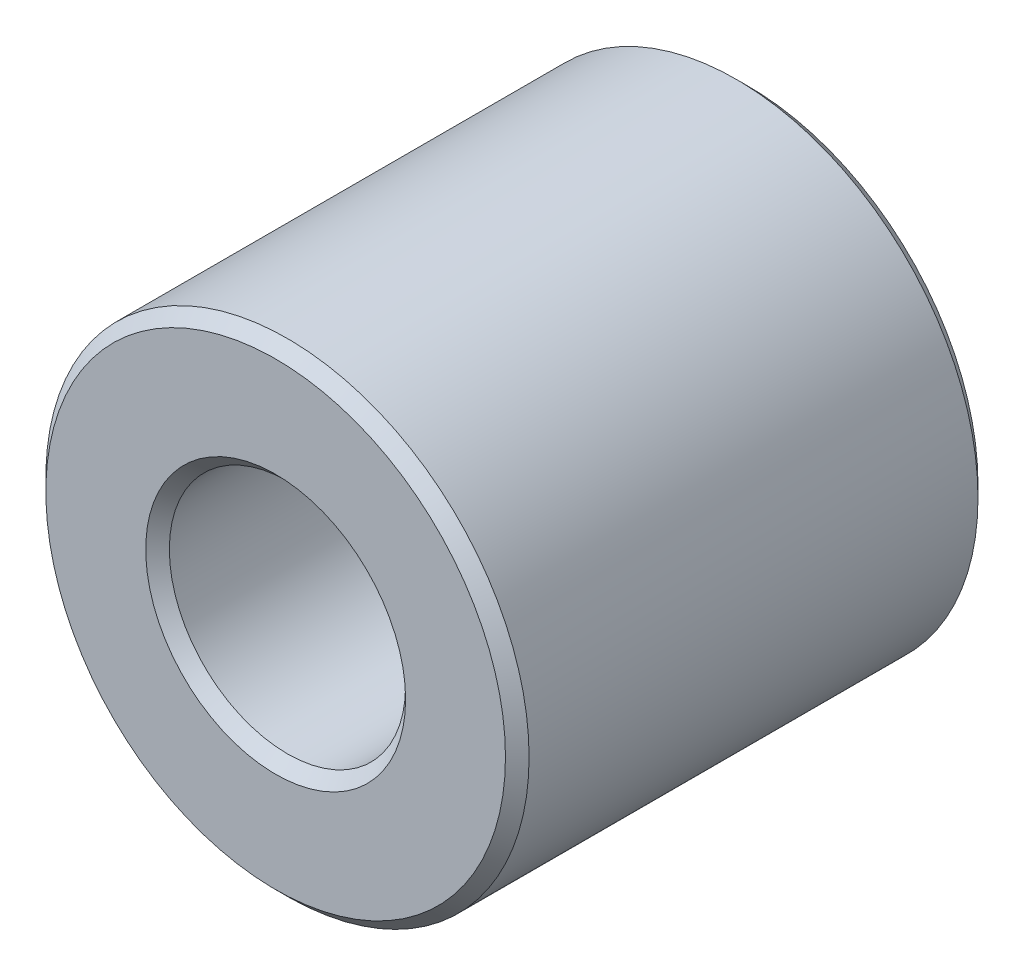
ISO-10303-21;
HEADER;
FILE_DESCRIPTION(('STEP AP214'),'2;1');
FILE_NAME('part.step','',(''),(''),'','','');
FILE_SCHEMA(('AUTOMOTIVE_DESIGN { 1 0 10303 214 1 1 1 1 }'));
ENDSEC;
DATA;
#1=APPLICATION_CONTEXT('core data for automotive mechanical design processes');
#2=APPLICATION_PROTOCOL_DEFINITION('international standard','automotive_design',2000,#1);
#3=PRODUCT_CONTEXT('',#1,'mechanical');
#4=PRODUCT('Part','Part','',(#3));
#5=PRODUCT_RELATED_PRODUCT_CATEGORY('part','',(#4));
#6=PRODUCT_DEFINITION_FORMATION('','',#4);
#7=PRODUCT_DEFINITION_CONTEXT('part definition',#1,'design');
#8=PRODUCT_DEFINITION('design','',#6,#7);
#9=PRODUCT_DEFINITION_SHAPE('','',#8);
#10=(LENGTH_UNIT() NAMED_UNIT(*) SI_UNIT(.MILLI.,.METRE.));
#11=(NAMED_UNIT(*) PLANE_ANGLE_UNIT() SI_UNIT($,.RADIAN.));
#12=(NAMED_UNIT(*) SI_UNIT($,.STERADIAN.) SOLID_ANGLE_UNIT());
#13=UNCERTAINTY_MEASURE_WITH_UNIT(LENGTH_MEASURE(1.E-05),#10,'distance_accuracy_value','');
#14=(GEOMETRIC_REPRESENTATION_CONTEXT(3) GLOBAL_UNCERTAINTY_ASSIGNED_CONTEXT((#13)) GLOBAL_UNIT_ASSIGNED_CONTEXT((#10,
#11,#12)) REPRESENTATION_CONTEXT('',''));
#15=CARTESIAN_POINT('',(0.,0.,0.));
#16=DIRECTION('',(0.,0.,1.));
#17=DIRECTION('',(1.,0.,0.));
#18=AXIS2_PLACEMENT_3D('',#15,#16,#17);
#19=CARTESIAN_POINT('',(0.,0.,22.));
#20=DIRECTION('',(0.,0.,1.));
#21=DIRECTION('',(1.,0.,0.));
#22=AXIS2_PLACEMENT_3D('',#19,#20,#21);
#23=PLANE('',#22);
#24=CARTESIAN_POINT('',(0.,0.,22.));
#25=DIRECTION('',(0.,0.,1.));
#26=DIRECTION('',(1.,0.,0.));
#27=AXIS2_PLACEMENT_3D('',#24,#25,#26);
#28=CIRCLE('',#27,12.1);
#29=CARTESIAN_POINT('',(12.1,0.,22.));
#30=VERTEX_POINT('',#29);
#31=EDGE_CURVE('E10',#30,#30,#28,.F.);
#32=ORIENTED_EDGE('',*,*,#31,.T.);
#33=EDGE_LOOP('',(#32));
#34=FACE_BOUND('',#33,.T.);
#35=CARTESIAN_POINT('',(0.,0.,22.));
#36=DIRECTION('',(0.,0.,1.));
#37=DIRECTION('',(1.,0.,0.));
#38=AXIS2_PLACEMENT_3D('',#35,#36,#37);
#39=CIRCLE('',#38,21.4);
#40=CARTESIAN_POINT('',(21.4,0.,22.));
#41=VERTEX_POINT('',#40);
#42=EDGE_CURVE('E45',#41,#41,#39,.T.);
#43=ORIENTED_EDGE('',*,*,#42,.T.);
#44=EDGE_LOOP('',(#43));
#45=FACE_BOUND('',#44,.T.);
#46=ADVANCED_FACE('F37',(#34,#45),#23,.T.);
#47=CARTESIAN_POINT('',(0.,0.,-22.));
#48=DIRECTION('',(0.,0.,1.));
#49=DIRECTION('',(1.,0.,0.));
#50=AXIS2_PLACEMENT_3D('',#47,#48,#49);
#51=PLANE('',#50);
#52=CARTESIAN_POINT('',(0.,0.,-22.));
#53=DIRECTION('',(0.,0.,1.));
#54=DIRECTION('',(1.,0.,0.));
#55=AXIS2_PLACEMENT_3D('',#52,#53,#54);
#56=CIRCLE('',#55,12.1);
#57=CARTESIAN_POINT('',(12.1,0.,-22.));
#58=VERTEX_POINT('',#57);
#59=EDGE_CURVE('E71',#58,#58,#56,.T.);
#60=ORIENTED_EDGE('',*,*,#59,.T.);
#61=EDGE_LOOP('',(#60));
#62=FACE_BOUND('',#61,.T.);
#63=CARTESIAN_POINT('',(0.,0.,-22.));
#64=DIRECTION('',(0.,0.,1.));
#65=DIRECTION('',(1.,0.,0.));
#66=AXIS2_PLACEMENT_3D('',#63,#64,#65);
#67=CIRCLE('',#66,21.4);
#68=CARTESIAN_POINT('',(21.4,0.,-22.));
#69=VERTEX_POINT('',#68);
#70=EDGE_CURVE('E74',#69,#69,#67,.F.);
#71=ORIENTED_EDGE('',*,*,#70,.T.);
#72=EDGE_LOOP('',(#71));
#73=FACE_BOUND('',#72,.T.);
#74=ADVANCED_FACE('F78',(#62,#73),#51,.F.);
#75=CARTESIAN_POINT('',(0.,0.,22.));
#76=DIRECTION('',(0.,0.,-1.));
#77=DIRECTION('',(-1.,0.,0.));
#78=AXIS2_PLACEMENT_3D('',#75,#76,#77);
#79=CYLINDRICAL_SURFACE('',#78,22.5);
#80=CARTESIAN_POINT('',(0.,0.,-20.9));
#81=DIRECTION('',(0.,0.,1.));
#82=DIRECTION('',(1.,0.,0.));
#83=AXIS2_PLACEMENT_3D('',#80,#81,#82);
#84=CIRCLE('',#83,22.5);
#85=CARTESIAN_POINT('',(22.5,0.,-20.9));
#86=VERTEX_POINT('',#85);
#87=EDGE_CURVE('E51',#86,#86,#84,.T.);
#88=ORIENTED_EDGE('',*,*,#87,.T.);
#89=EDGE_LOOP('',(#88));
#90=FACE_BOUND('',#89,.T.);
#91=CARTESIAN_POINT('',(0.,0.,20.9));
#92=DIRECTION('',(0.,0.,1.));
#93=DIRECTION('',(1.,0.,0.));
#94=AXIS2_PLACEMENT_3D('',#91,#92,#93);
#95=CIRCLE('',#94,22.5);
#96=CARTESIAN_POINT('',(22.5,0.,20.9));
#97=VERTEX_POINT('',#96);
#98=EDGE_CURVE('E57',#97,#97,#95,.F.);
#99=ORIENTED_EDGE('',*,*,#98,.T.);
#100=EDGE_LOOP('',(#99));
#101=FACE_BOUND('',#100,.T.);
#102=ADVANCED_FACE('F88',(#90,#101),#79,.T.);
#103=CARTESIAN_POINT('',(0.,0.,22.));
#104=DIRECTION('',(0.,0.,-1.));
#105=DIRECTION('',(-1.,0.,0.));
#106=AXIS2_PLACEMENT_3D('',#103,#104,#105);
#107=CYLINDRICAL_SURFACE('',#106,11.);
#108=CARTESIAN_POINT('',(0.,0.,-20.9));
#109=DIRECTION('',(0.,0.,1.));
#110=DIRECTION('',(1.,0.,0.));
#111=AXIS2_PLACEMENT_3D('',#108,#109,#110);
#112=CIRCLE('',#111,11.);
#113=CARTESIAN_POINT('',(11.,0.,-20.9));
#114=VERTEX_POINT('',#113);
#115=EDGE_CURVE('E63',#114,#114,#112,.F.);
#116=ORIENTED_EDGE('',*,*,#115,.T.);
#117=EDGE_LOOP('',(#116));
#118=FACE_BOUND('',#117,.T.);
#119=CARTESIAN_POINT('',(0.,0.,20.9));
#120=DIRECTION('',(0.,0.,1.));
#121=DIRECTION('',(1.,0.,0.));
#122=AXIS2_PLACEMENT_3D('',#119,#120,#121);
#123=CIRCLE('',#122,11.);
#124=CARTESIAN_POINT('',(11.,0.,20.9));
#125=VERTEX_POINT('',#124);
#126=EDGE_CURVE('E67',#125,#125,#123,.T.);
#127=ORIENTED_EDGE('',*,*,#126,.T.);
#128=EDGE_LOOP('',(#127));
#129=FACE_BOUND('',#128,.T.);
#130=ADVANCED_FACE('F91',(#118,#129),#107,.F.);
#131=CARTESIAN_POINT('',(0.,0.,-22.));
#132=DIRECTION('',(0.,0.,-1.));
#133=DIRECTION('',(-1.,0.,0.));
#134=AXIS2_PLACEMENT_3D('',#131,#132,#133);
#135=CONICAL_SURFACE('',#134,12.1,0.78539816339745);
#136=ORIENTED_EDGE('',*,*,#115,.F.);
#137=EDGE_LOOP('',(#136));
#138=FACE_BOUND('',#137,.T.);
#139=ORIENTED_EDGE('',*,*,#59,.F.);
#140=EDGE_LOOP('',(#139));
#141=FACE_BOUND('',#140,.T.);
#142=ADVANCED_FACE('F84',(#138,#141),#135,.F.);
#143=CARTESIAN_POINT('',(0.,0.,-20.9));
#144=DIRECTION('',(0.,0.,1.));
#145=DIRECTION('',(1.,0.,0.));
#146=AXIS2_PLACEMENT_3D('',#143,#144,#145);
#147=CONICAL_SURFACE('',#146,22.5,0.78539816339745);
#148=ORIENTED_EDGE('',*,*,#70,.F.);
#149=EDGE_LOOP('',(#148));
#150=FACE_BOUND('',#149,.T.);
#151=ORIENTED_EDGE('',*,*,#87,.F.);
#152=EDGE_LOOP('',(#151));
#153=FACE_BOUND('',#152,.T.);
#154=ADVANCED_FACE('F80',(#150,#153),#147,.T.);
#155=CARTESIAN_POINT('',(0.,0.,20.9));
#156=DIRECTION('',(0.,0.,1.));
#157=DIRECTION('',(1.,0.,0.));
#158=AXIS2_PLACEMENT_3D('',#155,#156,#157);
#159=CONICAL_SURFACE('',#158,11.,0.78539816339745);
#160=ORIENTED_EDGE('',*,*,#31,.F.);
#161=EDGE_LOOP('',(#160));
#162=FACE_BOUND('',#161,.T.);
#163=ORIENTED_EDGE('',*,*,#126,.F.);
#164=EDGE_LOOP('',(#163));
#165=FACE_BOUND('',#164,.T.);
#166=ADVANCED_FACE('F83',(#162,#165),#159,.F.);
#167=CARTESIAN_POINT('',(0.,0.,22.));
#168=DIRECTION('',(0.,0.,-1.));
#169=DIRECTION('',(-1.,0.,0.));
#170=AXIS2_PLACEMENT_3D('',#167,#168,#169);
#171=CONICAL_SURFACE('',#170,21.4,0.785398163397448);
#172=ORIENTED_EDGE('',*,*,#98,.F.);
#173=EDGE_LOOP('',(#172));
#174=FACE_BOUND('',#173,.T.);
#175=ORIENTED_EDGE('',*,*,#42,.F.);
#176=EDGE_LOOP('',(#175));
#177=FACE_BOUND('',#176,.T.);
#178=ADVANCED_FACE('F39',(#174,#177),#171,.T.);
#179=CLOSED_SHELL('',(#46,#74,#102,#130,#142,#154,#166,#178));
#180=MANIFOLD_SOLID_BREP('B2',#179);
#181=ADVANCED_BREP_SHAPE_REPRESENTATION('',(#18,#180),#14);
#182=SHAPE_DEFINITION_REPRESENTATION(#9,#181);
ENDSEC;
END-ISO-10303-21;
